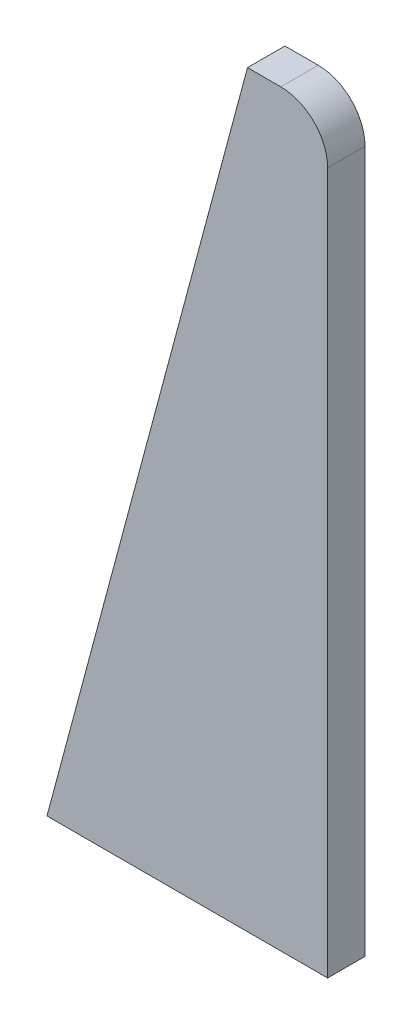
ISO-10303-21;
HEADER;
FILE_DESCRIPTION(('STEP AP214'),'2;1');
FILE_NAME('part.step','',(''),(''),'','','');
FILE_SCHEMA(('AUTOMOTIVE_DESIGN { 1 0 10303 214 1 1 1 1 }'));
ENDSEC;
DATA;
#1=APPLICATION_CONTEXT('core data for automotive mechanical design processes');
#2=APPLICATION_PROTOCOL_DEFINITION('international standard','automotive_design',2000,#1);
#3=PRODUCT_CONTEXT('',#1,'mechanical');
#4=PRODUCT('Part','Part','',(#3));
#5=PRODUCT_RELATED_PRODUCT_CATEGORY('part','',(#4));
#6=PRODUCT_DEFINITION_FORMATION('','',#4);
#7=PRODUCT_DEFINITION_CONTEXT('part definition',#1,'design');
#8=PRODUCT_DEFINITION('design','',#6,#7);
#9=PRODUCT_DEFINITION_SHAPE('','',#8);
#10=(LENGTH_UNIT() NAMED_UNIT(*) SI_UNIT(.MILLI.,.METRE.));
#11=(NAMED_UNIT(*) PLANE_ANGLE_UNIT() SI_UNIT($,.RADIAN.));
#12=(NAMED_UNIT(*) SI_UNIT($,.STERADIAN.) SOLID_ANGLE_UNIT());
#13=UNCERTAINTY_MEASURE_WITH_UNIT(LENGTH_MEASURE(1.E-05),#10,'distance_accuracy_value','');
#14=(GEOMETRIC_REPRESENTATION_CONTEXT(3) GLOBAL_UNCERTAINTY_ASSIGNED_CONTEXT((#13)) GLOBAL_UNIT_ASSIGNED_CONTEXT((#10,
#11,#12)) REPRESENTATION_CONTEXT('',''));
#15=CARTESIAN_POINT('',(0.,0.,0.));
#16=DIRECTION('',(0.,0.,1.));
#17=DIRECTION('',(1.,0.,0.));
#18=AXIS2_PLACEMENT_3D('',#15,#16,#17);
#19=CARTESIAN_POINT('',(42.8718707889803,160.,8.));
#20=DIRECTION('',(0.965925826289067,-0.258819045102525,0.));
#21=DIRECTION('',(0.258819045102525,0.965925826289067,0.));
#22=AXIS2_PLACEMENT_3D('',#19,#20,#21);
#23=PLANE('',#22);
#24=CARTESIAN_POINT('',(9.05866657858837,33.8074039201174,4.));
#25=DIRECTION('',(-0.965925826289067,0.258819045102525,0.));
#26=DIRECTION('',(-0.258819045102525,-0.965925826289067,0.));
#27=AXIS2_PLACEMENT_3D('',#24,#25,#26);
#28=CIRCLE('',#27,2.1);
#29=CARTESIAN_POINT('',(8.51514658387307,31.7789596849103,4.));
#30=VERTEX_POINT('',#29);
#31=EDGE_CURVE('E116',#30,#30,#28,.T.);
#32=ORIENTED_EDGE('',*,*,#31,.F.);
#33=EDGE_LOOP('',(#32));
#34=FACE_BOUND('',#33,.T.);
#35=CARTESIAN_POINT('',(28.4700949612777,106.251840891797,4.));
#36=DIRECTION('',(-0.965925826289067,0.258819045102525,0.));
#37=DIRECTION('',(-0.258819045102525,-0.965925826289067,0.));
#38=AXIS2_PLACEMENT_3D('',#35,#36,#37);
#39=CIRCLE('',#38,2.1);
#40=CARTESIAN_POINT('',(27.9265749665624,104.22339665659,4.));
#41=VERTEX_POINT('',#40);
#42=EDGE_CURVE('E122',#41,#41,#39,.T.);
#43=ORIENTED_EDGE('',*,*,#42,.F.);
#44=EDGE_LOOP('',(#43));
#45=FACE_BOUND('',#44,.T.);
#46=DIRECTION('',(-0.258819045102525,-0.965925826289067,0.));
#47=VECTOR('',#46,1.);
#48=CARTESIAN_POINT('',(42.8718707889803,160.,0.));
#49=LINE('',#48,#47);
#50=CARTESIAN_POINT('',(42.8718707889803,160.,0.));
#51=VERTEX_POINT('',#50);
#52=CARTESIAN_POINT('',(0.,0.,0.));
#53=VERTEX_POINT('',#52);
#54=EDGE_CURVE('E128',#51,#53,#49,.T.);
#55=ORIENTED_EDGE('',*,*,#54,.T.);
#56=DIRECTION('',(0.,0.,-1.));
#57=VECTOR('',#56,1.);
#58=CARTESIAN_POINT('',(0.,0.,8.));
#59=LINE('',#58,#57);
#60=CARTESIAN_POINT('',(0.,0.,8.));
#61=VERTEX_POINT('',#60);
#62=EDGE_CURVE('E152',#61,#53,#59,.T.);
#63=ORIENTED_EDGE('',*,*,#62,.F.);
#64=DIRECTION('',(-0.258819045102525,-0.965925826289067,0.));
#65=VECTOR('',#64,1.);
#66=CARTESIAN_POINT('',(42.8718707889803,160.,8.));
#67=LINE('',#66,#65);
#68=CARTESIAN_POINT('',(42.8718707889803,160.,8.));
#69=VERTEX_POINT('',#68);
#70=EDGE_CURVE('E129',#69,#61,#67,.T.);
#71=ORIENTED_EDGE('',*,*,#70,.F.);
#72=DIRECTION('',(0.,0.,-1.));
#73=VECTOR('',#72,1.);
#74=CARTESIAN_POINT('',(42.8718707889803,160.,8.));
#75=LINE('',#74,#73);
#76=EDGE_CURVE('E139',#69,#51,#75,.T.);
#77=ORIENTED_EDGE('',*,*,#76,.T.);
#78=EDGE_LOOP('',(#55,#63,#71,#77));
#79=FACE_BOUND('',#78,.T.);
#80=ADVANCED_FACE('F38',(#34,#45,#79),#23,.F.);
#81=CARTESIAN_POINT('',(0.,0.,8.));
#82=DIRECTION('',(0.,1.,0.));
#83=DIRECTION('',(0.,0.,1.));
#84=AXIS2_PLACEMENT_3D('',#81,#82,#83);
#85=PLANE('',#84);
#86=CARTESIAN_POINT('',(22.,0.,4.));
#87=DIRECTION('',(0.,-1.,0.));
#88=DIRECTION('',(0.,0.,-1.));
#89=AXIS2_PLACEMENT_3D('',#86,#87,#88);
#90=CIRCLE('',#89,2.09999999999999);
#91=CARTESIAN_POINT('',(22.,0.,1.90000000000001));
#92=VERTEX_POINT('',#91);
#93=EDGE_CURVE('E106',#92,#92,#90,.T.);
#94=ORIENTED_EDGE('',*,*,#93,.F.);
#95=EDGE_LOOP('',(#94));
#96=FACE_BOUND('',#95,.T.);
#97=CARTESIAN_POINT('',(52.,0.,4.00000000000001));
#98=DIRECTION('',(0.,-1.,0.));
#99=DIRECTION('',(0.,0.,-1.));
#100=AXIS2_PLACEMENT_3D('',#97,#98,#99);
#101=CIRCLE('',#100,2.09999999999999);
#102=CARTESIAN_POINT('',(52.,0.,1.90000000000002));
#103=VERTEX_POINT('',#102);
#104=EDGE_CURVE('E105',#103,#103,#101,.T.);
#105=ORIENTED_EDGE('',*,*,#104,.F.);
#106=EDGE_LOOP('',(#105));
#107=FACE_BOUND('',#106,.T.);
#108=DIRECTION('',(1.,0.,0.));
#109=VECTOR('',#108,1.);
#110=CARTESIAN_POINT('',(0.,0.,0.));
#111=LINE('',#110,#109);
#112=CARTESIAN_POINT('',(60.,0.,0.));
#113=VERTEX_POINT('',#112);
#114=EDGE_CURVE('E142',#53,#113,#111,.T.);
#115=ORIENTED_EDGE('',*,*,#114,.T.);
#116=DIRECTION('',(0.,0.,-1.));
#117=VECTOR('',#116,1.);
#118=CARTESIAN_POINT('',(60.,0.,8.));
#119=LINE('',#118,#117);
#120=CARTESIAN_POINT('',(60.,0.,8.));
#121=VERTEX_POINT('',#120);
#122=EDGE_CURVE('E149',#121,#113,#119,.T.);
#123=ORIENTED_EDGE('',*,*,#122,.F.);
#124=DIRECTION('',(1.,0.,0.));
#125=VECTOR('',#124,1.);
#126=CARTESIAN_POINT('',(0.,0.,8.));
#127=LINE('',#126,#125);
#128=EDGE_CURVE('E132',#61,#121,#127,.T.);
#129=ORIENTED_EDGE('',*,*,#128,.F.);
#130=ORIENTED_EDGE('',*,*,#62,.T.);
#131=EDGE_LOOP('',(#115,#123,#129,#130));
#132=FACE_BOUND('',#131,.T.);
#133=ADVANCED_FACE('F179',(#96,#107,#132),#85,.F.);
#134=CARTESIAN_POINT('',(60.,0.,8.));
#135=DIRECTION('',(-1.,0.,0.));
#136=DIRECTION('',(0.,0.,1.));
#137=AXIS2_PLACEMENT_3D('',#134,#135,#136);
#138=PLANE('',#137);
#139=DIRECTION('',(0.,1.,0.));
#140=VECTOR('',#139,1.);
#141=CARTESIAN_POINT('',(60.,0.,0.));
#142=LINE('',#141,#140);
#143=CARTESIAN_POINT('',(60.,150.,0.));
#144=VERTEX_POINT('',#143);
#145=EDGE_CURVE('E144',#113,#144,#142,.T.);
#146=ORIENTED_EDGE('',*,*,#145,.T.);
#147=DIRECTION('',(0.,0.,-1.));
#148=VECTOR('',#147,1.);
#149=CARTESIAN_POINT('',(60.,150.,8.));
#150=LINE('',#149,#148);
#151=CARTESIAN_POINT('',(60.,150.,8.));
#152=VERTEX_POINT('',#151);
#153=EDGE_CURVE('E46',#144,#152,#150,.F.);
#154=ORIENTED_EDGE('',*,*,#153,.T.);
#155=DIRECTION('',(0.,1.,0.));
#156=VECTOR('',#155,1.);
#157=CARTESIAN_POINT('',(60.,0.,8.));
#158=LINE('',#157,#156);
#159=EDGE_CURVE('E135',#121,#152,#158,.T.);
#160=ORIENTED_EDGE('',*,*,#159,.F.);
#161=ORIENTED_EDGE('',*,*,#122,.T.);
#162=EDGE_LOOP('',(#146,#154,#160,#161));
#163=FACE_BOUND('',#162,.T.);
#164=ADVANCED_FACE('F184',(#163),#138,.F.);
#165=CARTESIAN_POINT('',(42.8718707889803,160.,8.));
#166=DIRECTION('',(0.,-1.,0.));
#167=DIRECTION('',(0.,0.,-1.));
#168=AXIS2_PLACEMENT_3D('',#165,#166,#167);
#169=PLANE('',#168);
#170=DIRECTION('',(-1.,0.,0.));
#171=VECTOR('',#170,1.);
#172=CARTESIAN_POINT('',(42.8718707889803,160.,8.));
#173=LINE('',#172,#171);
#174=CARTESIAN_POINT('',(50.,160.,8.));
#175=VERTEX_POINT('',#174);
#176=EDGE_CURVE('E137',#175,#69,#173,.T.);
#177=ORIENTED_EDGE('',*,*,#176,.F.);
#178=DIRECTION('',(0.,0.,-1.));
#179=VECTOR('',#178,1.);
#180=CARTESIAN_POINT('',(50.,160.,8.));
#181=LINE('',#180,#179);
#182=CARTESIAN_POINT('',(50.,160.,0.));
#183=VERTEX_POINT('',#182);
#184=EDGE_CURVE('E155',#175,#183,#181,.T.);
#185=ORIENTED_EDGE('',*,*,#184,.T.);
#186=DIRECTION('',(-1.,0.,0.));
#187=VECTOR('',#186,1.);
#188=CARTESIAN_POINT('',(42.8718707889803,160.,0.));
#189=LINE('',#188,#187);
#190=EDGE_CURVE('E133',#183,#51,#189,.T.);
#191=ORIENTED_EDGE('',*,*,#190,.T.);
#192=ORIENTED_EDGE('',*,*,#76,.F.);
#193=EDGE_LOOP('',(#177,#185,#191,#192));
#194=FACE_BOUND('',#193,.T.);
#195=ADVANCED_FACE('F161',(#194),#169,.F.);
#196=CARTESIAN_POINT('',(0.,0.,8.));
#197=DIRECTION('',(0.,0.,1.));
#198=DIRECTION('',(1.,0.,0.));
#199=AXIS2_PLACEMENT_3D('',#196,#197,#198);
#200=PLANE('',#199);
#201=ORIENTED_EDGE('',*,*,#159,.T.);
#202=CARTESIAN_POINT('',(50.,150.,8.));
#203=DIRECTION('',(0.,0.,1.));
#204=DIRECTION('',(1.,0.,0.));
#205=AXIS2_PLACEMENT_3D('',#202,#203,#204);
#206=CIRCLE('',#205,10.);
#207=EDGE_CURVE('E11',#152,#175,#206,.T.);
#208=ORIENTED_EDGE('',*,*,#207,.T.);
#209=ORIENTED_EDGE('',*,*,#176,.T.);
#210=ORIENTED_EDGE('',*,*,#70,.T.);
#211=ORIENTED_EDGE('',*,*,#128,.T.);
#212=EDGE_LOOP('',(#201,#208,#209,#210,#211));
#213=FACE_BOUND('',#212,.T.);
#214=ADVANCED_FACE('F171',(#213),#200,.T.);
#215=CARTESIAN_POINT('',(0.,0.,0.));
#216=DIRECTION('',(0.,0.,1.));
#217=DIRECTION('',(1.,0.,0.));
#218=AXIS2_PLACEMENT_3D('',#215,#216,#217);
#219=PLANE('',#218);
#220=ORIENTED_EDGE('',*,*,#190,.F.);
#221=CARTESIAN_POINT('',(50.,150.,0.));
#222=DIRECTION('',(0.,0.,1.));
#223=DIRECTION('',(1.,0.,0.));
#224=AXIS2_PLACEMENT_3D('',#221,#222,#223);
#225=CIRCLE('',#224,10.);
#226=EDGE_CURVE('E60',#183,#144,#225,.F.);
#227=ORIENTED_EDGE('',*,*,#226,.T.);
#228=ORIENTED_EDGE('',*,*,#145,.F.);
#229=ORIENTED_EDGE('',*,*,#114,.F.);
#230=ORIENTED_EDGE('',*,*,#54,.F.);
#231=EDGE_LOOP('',(#220,#227,#228,#229,#230));
#232=FACE_BOUND('',#231,.T.);
#233=ADVANCED_FACE('F166',(#232),#219,.F.);
#234=CARTESIAN_POINT('',(41.9930565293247,102.628374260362,4.));
#235=DIRECTION('',(-0.965925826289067,0.258819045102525,0.));
#236=DIRECTION('',(-0.258819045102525,-0.965925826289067,0.));
#237=AXIS2_PLACEMENT_3D('',#234,#235,#236);
#238=CONICAL_SURFACE('',#237,2.1,1.02974425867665);
#239=CARTESIAN_POINT('',(43.2118687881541,102.301794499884,4.));
#240=VERTEX_POINT('',#239);
#241=VERTEX_LOOP('',#240);
#242=FACE_BOUND('',#241,.T.);
#243=CARTESIAN_POINT('',(41.9930565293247,102.628374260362,4.));
#244=DIRECTION('',(-0.965925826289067,0.258819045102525,0.));
#245=DIRECTION('',(-0.258819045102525,-0.965925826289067,0.));
#246=AXIS2_PLACEMENT_3D('',#243,#244,#245);
#247=CIRCLE('',#246,2.1);
#248=CARTESIAN_POINT('',(41.4495365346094,100.599930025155,4.));
#249=VERTEX_POINT('',#248);
#250=EDGE_CURVE('E125',#249,#249,#247,.T.);
#251=ORIENTED_EDGE('',*,*,#250,.T.);
#252=EDGE_LOOP('',(#251));
#253=FACE_BOUND('',#252,.T.);
#254=ADVANCED_FACE('F196',(#242,#253),#238,.F.);
#255=CARTESIAN_POINT('',(28.4700949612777,106.251840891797,4.));
#256=DIRECTION('',(-0.965925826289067,0.258819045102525,0.));
#257=DIRECTION('',(-0.258819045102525,-0.965925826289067,0.));
#258=AXIS2_PLACEMENT_3D('',#255,#256,#257);
#259=CYLINDRICAL_SURFACE('',#258,2.1);
#260=ORIENTED_EDGE('',*,*,#250,.F.);
#261=EDGE_LOOP('',(#260));
#262=FACE_BOUND('',#261,.T.);
#263=ORIENTED_EDGE('',*,*,#42,.T.);
#264=EDGE_LOOP('',(#263));
#265=FACE_BOUND('',#264,.T.);
#266=ADVANCED_FACE('F201',(#262,#265),#259,.F.);
#267=CARTESIAN_POINT('',(22.5816281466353,30.183937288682,4.));
#268=DIRECTION('',(-0.965925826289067,0.258819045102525,0.));
#269=DIRECTION('',(-0.258819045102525,-0.965925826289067,0.));
#270=AXIS2_PLACEMENT_3D('',#267,#268,#269);
#271=CONICAL_SURFACE('',#270,2.1,1.02974425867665);
#272=CARTESIAN_POINT('',(23.8004404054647,29.8573575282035,4.));
#273=VERTEX_POINT('',#272);
#274=VERTEX_LOOP('',#273);
#275=FACE_BOUND('',#274,.T.);
#276=CARTESIAN_POINT('',(22.5816281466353,30.183937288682,4.));
#277=DIRECTION('',(-0.965925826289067,0.258819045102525,0.));
#278=DIRECTION('',(-0.258819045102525,-0.965925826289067,0.));
#279=AXIS2_PLACEMENT_3D('',#276,#277,#278);
#280=CIRCLE('',#279,2.1);
#281=CARTESIAN_POINT('',(22.03810815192,28.155493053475,4.));
#282=VERTEX_POINT('',#281);
#283=EDGE_CURVE('E119',#282,#282,#280,.T.);
#284=ORIENTED_EDGE('',*,*,#283,.T.);
#285=EDGE_LOOP('',(#284));
#286=FACE_BOUND('',#285,.T.);
#287=ADVANCED_FACE('F205',(#275,#286),#271,.F.);
#288=CARTESIAN_POINT('',(9.05866657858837,33.8074039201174,4.));
#289=DIRECTION('',(-0.965925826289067,0.258819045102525,0.));
#290=DIRECTION('',(-0.258819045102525,-0.965925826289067,0.));
#291=AXIS2_PLACEMENT_3D('',#288,#289,#290);
#292=CYLINDRICAL_SURFACE('',#291,2.1);
#293=ORIENTED_EDGE('',*,*,#283,.F.);
#294=EDGE_LOOP('',(#293));
#295=FACE_BOUND('',#294,.T.);
#296=ORIENTED_EDGE('',*,*,#31,.T.);
#297=EDGE_LOOP('',(#296));
#298=FACE_BOUND('',#297,.T.);
#299=ADVANCED_FACE('F209',(#295,#298),#292,.F.);
#300=CARTESIAN_POINT('',(52.,14.,4.00000000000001));
#301=DIRECTION('',(0.,-1.,0.));
#302=DIRECTION('',(0.,0.,-1.));
#303=AXIS2_PLACEMENT_3D('',#300,#301,#302);
#304=CONICAL_SURFACE('',#303,2.09999999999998,1.02974425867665);
#305=CARTESIAN_POINT('',(52.,15.2618072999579,4.00000000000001));
#306=VERTEX_POINT('',#305);
#307=VERTEX_LOOP('',#306);
#308=FACE_BOUND('',#307,.T.);
#309=CARTESIAN_POINT('',(52.,14.,4.00000000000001));
#310=DIRECTION('',(0.,-1.,0.));
#311=DIRECTION('',(0.,0.,-1.));
#312=AXIS2_PLACEMENT_3D('',#309,#310,#311);
#313=CIRCLE('',#312,2.09999999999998);
#314=CARTESIAN_POINT('',(52.,14.,1.90000000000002));
#315=VERTEX_POINT('',#314);
#316=EDGE_CURVE('E109',#315,#315,#313,.T.);
#317=ORIENTED_EDGE('',*,*,#316,.T.);
#318=EDGE_LOOP('',(#317));
#319=FACE_BOUND('',#318,.T.);
#320=ADVANCED_FACE('F213',(#308,#319),#304,.F.);
#321=CARTESIAN_POINT('',(52.,0.,4.00000000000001));
#322=DIRECTION('',(0.,-1.,0.));
#323=DIRECTION('',(0.,0.,-1.));
#324=AXIS2_PLACEMENT_3D('',#321,#322,#323);
#325=CYLINDRICAL_SURFACE('',#324,2.09999999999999);
#326=ORIENTED_EDGE('',*,*,#316,.F.);
#327=EDGE_LOOP('',(#326));
#328=FACE_BOUND('',#327,.T.);
#329=ORIENTED_EDGE('',*,*,#104,.T.);
#330=EDGE_LOOP('',(#329));
#331=FACE_BOUND('',#330,.T.);
#332=ADVANCED_FACE('F99',(#328,#331),#325,.F.);
#333=CARTESIAN_POINT('',(22.,14.,4.));
#334=DIRECTION('',(0.,-1.,0.));
#335=DIRECTION('',(0.,0.,-1.));
#336=AXIS2_PLACEMENT_3D('',#333,#334,#335);
#337=CONICAL_SURFACE('',#336,2.09999999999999,1.02974425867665);
#338=CARTESIAN_POINT('',(22.,15.2618072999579,4.));
#339=VERTEX_POINT('',#338);
#340=VERTEX_LOOP('',#339);
#341=FACE_BOUND('',#340,.T.);
#342=CARTESIAN_POINT('',(22.,14.,4.));
#343=DIRECTION('',(0.,-1.,0.));
#344=DIRECTION('',(0.,0.,-1.));
#345=AXIS2_PLACEMENT_3D('',#342,#343,#344);
#346=CIRCLE('',#345,2.09999999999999);
#347=CARTESIAN_POINT('',(22.,14.,1.90000000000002));
#348=VERTEX_POINT('',#347);
#349=EDGE_CURVE('E103',#348,#348,#346,.T.);
#350=ORIENTED_EDGE('',*,*,#349,.T.);
#351=EDGE_LOOP('',(#350));
#352=FACE_BOUND('',#351,.T.);
#353=ADVANCED_FACE('F95',(#341,#352),#337,.F.);
#354=CARTESIAN_POINT('',(22.,0.,4.));
#355=DIRECTION('',(0.,-1.,0.));
#356=DIRECTION('',(0.,0.,-1.));
#357=AXIS2_PLACEMENT_3D('',#354,#355,#356);
#358=CYLINDRICAL_SURFACE('',#357,2.09999999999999);
#359=ORIENTED_EDGE('',*,*,#349,.F.);
#360=EDGE_LOOP('',(#359));
#361=FACE_BOUND('',#360,.T.);
#362=ORIENTED_EDGE('',*,*,#93,.T.);
#363=EDGE_LOOP('',(#362));
#364=FACE_BOUND('',#363,.T.);
#365=ADVANCED_FACE('F98',(#361,#364),#358,.F.);
#366=CARTESIAN_POINT('',(50.,150.,8.));
#367=DIRECTION('',(0.,0.,-1.));
#368=DIRECTION('',(-1.,0.,0.));
#369=AXIS2_PLACEMENT_3D('',#366,#367,#368);
#370=CYLINDRICAL_SURFACE('',#369,10.);
#371=ORIENTED_EDGE('',*,*,#207,.F.);
#372=ORIENTED_EDGE('',*,*,#153,.F.);
#373=ORIENTED_EDGE('',*,*,#226,.F.);
#374=ORIENTED_EDGE('',*,*,#184,.F.);
#375=EDGE_LOOP('',(#371,#372,#373,#374));
#376=FACE_BOUND('',#375,.T.);
#377=ADVANCED_FACE('F40',(#376),#370,.T.);
#378=CLOSED_SHELL('',(#80,#133,#164,#195,#214,#233,#254,#266,#287,#299,#320,#332,#353,#365,#377));
#379=MANIFOLD_SOLID_BREP('B2',#378);
#380=ADVANCED_BREP_SHAPE_REPRESENTATION('',(#18,#379),#14);
#381=SHAPE_DEFINITION_REPRESENTATION(#9,#380);
ENDSEC;
END-ISO-10303-21;
